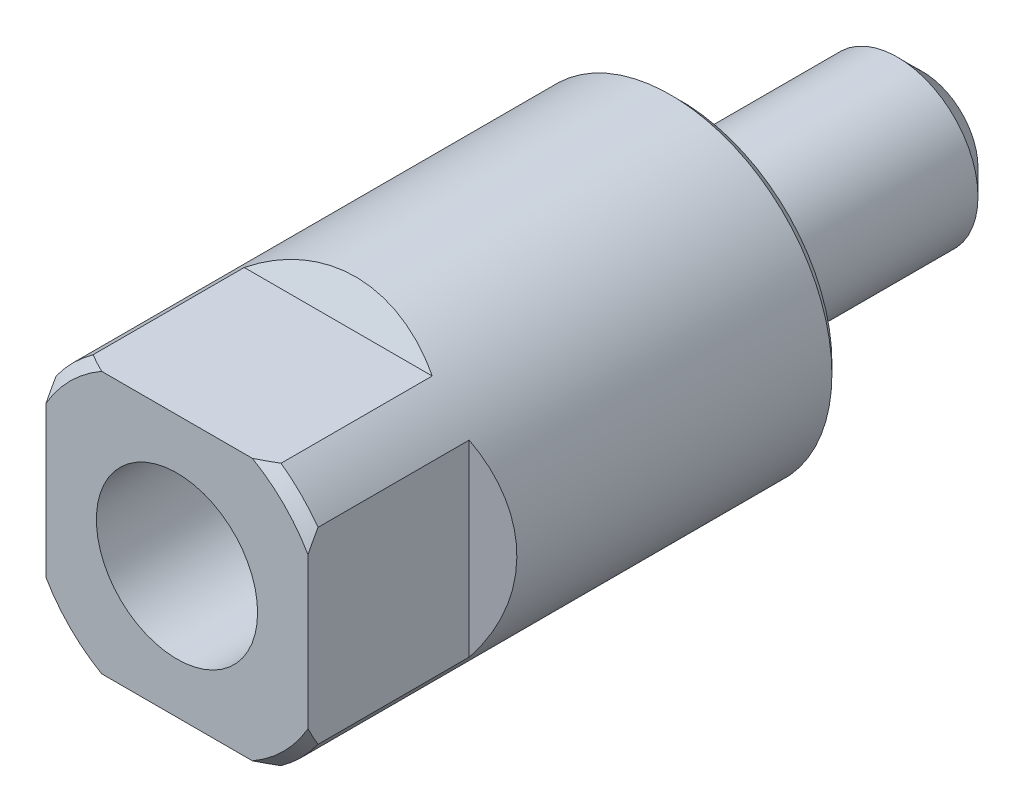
ISO-10303-21;
HEADER;
FILE_DESCRIPTION(('STEP AP214'),'2;1');
FILE_NAME('part.step','',(''),(''),'','','');
FILE_SCHEMA(('AUTOMOTIVE_DESIGN { 1 0 10303 214 1 1 1 1 }'));
ENDSEC;
DATA;
#1=APPLICATION_CONTEXT('core data for automotive mechanical design processes');
#2=APPLICATION_PROTOCOL_DEFINITION('international standard','automotive_design',2000,#1);
#3=PRODUCT_CONTEXT('',#1,'mechanical');
#4=PRODUCT('Part','Part','',(#3));
#5=PRODUCT_RELATED_PRODUCT_CATEGORY('part','',(#4));
#6=PRODUCT_DEFINITION_FORMATION('','',#4);
#7=PRODUCT_DEFINITION_CONTEXT('part definition',#1,'design');
#8=PRODUCT_DEFINITION('design','',#6,#7);
#9=PRODUCT_DEFINITION_SHAPE('','',#8);
#10=(LENGTH_UNIT() NAMED_UNIT(*) SI_UNIT(.MILLI.,.METRE.));
#11=(NAMED_UNIT(*) PLANE_ANGLE_UNIT() SI_UNIT($,.RADIAN.));
#12=(NAMED_UNIT(*) SI_UNIT($,.STERADIAN.) SOLID_ANGLE_UNIT());
#13=UNCERTAINTY_MEASURE_WITH_UNIT(LENGTH_MEASURE(1.E-05),#10,'distance_accuracy_value','');
#14=(GEOMETRIC_REPRESENTATION_CONTEXT(3) GLOBAL_UNCERTAINTY_ASSIGNED_CONTEXT((#13)) GLOBAL_UNIT_ASSIGNED_CONTEXT((#10,
#11,#12)) REPRESENTATION_CONTEXT('',''));
#15=CARTESIAN_POINT('',(0.,0.,0.));
#16=DIRECTION('',(0.,0.,1.));
#17=DIRECTION('',(1.,0.,0.));
#18=AXIS2_PLACEMENT_3D('',#15,#16,#17);
#19=CARTESIAN_POINT('',(0.,0.,-12.));
#20=DIRECTION('',(0.,0.,1.));
#21=DIRECTION('',(1.,0.,0.));
#22=AXIS2_PLACEMENT_3D('',#19,#20,#21);
#23=PLANE('',#22);
#24=CARTESIAN_POINT('',(0.,0.,-12.));
#25=DIRECTION('',(0.,0.,1.));
#26=DIRECTION('',(1.,0.,0.));
#27=AXIS2_PLACEMENT_3D('',#24,#25,#26);
#28=CIRCLE('',#27,2.75);
#29=CARTESIAN_POINT('',(2.75,0.,-12.));
#30=VERTEX_POINT('',#29);
#31=EDGE_CURVE('E142',#30,#30,#28,.F.);
#32=ORIENTED_EDGE('',*,*,#31,.T.);
#33=EDGE_LOOP('',(#32));
#34=FACE_BOUND('',#33,.T.);
#35=ADVANCED_FACE('F14',(#34),#23,.F.);
#36=CARTESIAN_POINT('',(0.,0.,8.));
#37=DIRECTION('',(0.,0.,1.));
#38=DIRECTION('',(1.,0.,0.));
#39=AXIS2_PLACEMENT_3D('',#36,#37,#38);
#40=CYLINDRICAL_SURFACE('',#39,4.);
#41=CARTESIAN_POINT('',(0.,0.,-10.75));
#42=DIRECTION('',(0.,0.,1.));
#43=DIRECTION('',(1.,0.,0.));
#44=AXIS2_PLACEMENT_3D('',#41,#42,#43);
#45=CIRCLE('',#44,4.);
#46=CARTESIAN_POINT('',(4.,0.,-10.75));
#47=VERTEX_POINT('',#46);
#48=EDGE_CURVE('E176',#47,#47,#45,.T.);
#49=ORIENTED_EDGE('',*,*,#48,.T.);
#50=EDGE_LOOP('',(#49));
#51=FACE_BOUND('',#50,.T.);
#52=CARTESIAN_POINT('',(0.,0.,0.));
#53=DIRECTION('',(0.,0.,1.));
#54=DIRECTION('',(1.,0.,0.));
#55=AXIS2_PLACEMENT_3D('',#52,#53,#54);
#56=CIRCLE('',#55,4.);
#57=CARTESIAN_POINT('',(4.,0.,0.));
#58=VERTEX_POINT('',#57);
#59=EDGE_CURVE('E139',#58,#58,#56,.T.);
#60=ORIENTED_EDGE('',*,*,#59,.F.);
#61=EDGE_LOOP('',(#60));
#62=FACE_BOUND('',#61,.T.);
#63=ADVANCED_FACE('F294',(#51,#62),#40,.T.);
#64=CARTESIAN_POINT('',(6.5,-8.,17.));
#65=DIRECTION('',(-0.5,0.,-0.866025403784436));
#66=DIRECTION('',(-0.866025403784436,0.,0.5));
#67=AXIS2_PLACEMENT_3D('',#64,#65,#66);
#68=PLANE('',#67);
#69=CARTESIAN_POINT('',(0.,0.,20.7527767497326));
#70=DIRECTION('',(-0.5,0.,-0.866025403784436));
#71=DIRECTION('',(0.866025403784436,0.,-0.5));
#72=AXIS2_PLACEMENT_3D('',#69,#70,#71);
#73=ELLIPSE('',#72,9.23760430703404,8.);
#74=CARTESIAN_POINT('',(6.5,4.66368952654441,17.));
#75=VERTEX_POINT('',#74);
#76=CARTESIAN_POINT('',(6.5,-4.66368952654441,17.));
#77=VERTEX_POINT('',#76);
#78=EDGE_CURVE('E159',#75,#77,#73,.T.);
#79=ORIENTED_EDGE('',*,*,#78,.F.);
#80=DIRECTION('',(0.,1.,0.));
#81=VECTOR('',#80,1.);
#82=CARTESIAN_POINT('',(6.5,-8.,17.));
#83=LINE('',#82,#81);
#84=EDGE_CURVE('E150',#77,#75,#83,.T.);
#85=ORIENTED_EDGE('',*,*,#84,.F.);
#86=EDGE_LOOP('',(#79,#85));
#87=FACE_BOUND('',#86,.T.);
#88=ADVANCED_FACE('F298',(#87),#68,.F.);
#89=CARTESIAN_POINT('',(6.5,-8.,25.));
#90=DIRECTION('',(-1.,0.,0.));
#91=DIRECTION('',(0.,0.,1.));
#92=AXIS2_PLACEMENT_3D('',#89,#90,#91);
#93=PLANE('',#92);
#94=DIRECTION('',(0.,0.,-1.));
#95=VECTOR('',#94,1.);
#96=CARTESIAN_POINT('',(6.5,4.6636895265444,25.));
#97=LINE('',#96,#95);
#98=CARTESIAN_POINT('',(6.5,4.6636895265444,24.5));
#99=VERTEX_POINT('',#98);
#100=EDGE_CURVE('E155',#99,#75,#97,.T.);
#101=ORIENTED_EDGE('',*,*,#100,.F.);
#102=CARTESIAN_POINT('',(6.5,4.6636895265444,24.5));
#103=CARTESIAN_POINT('',(6.5,4.58815546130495,24.5440319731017));
#104=CARTESIAN_POINT('',(6.5,4.51231410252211,24.5875397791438));
#105=CARTESIAN_POINT('',(6.5,4.36000596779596,24.6733985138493));
#106=CARTESIAN_POINT('',(6.5,4.2835393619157,24.7157497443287));
#107=CARTESIAN_POINT('',(6.5,4.12992806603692,24.7992112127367));
#108=CARTESIAN_POINT('',(6.5,4.05278335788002,24.8403214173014));
#109=CARTESIAN_POINT('',(6.5,3.89776768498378,24.9211989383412));
#110=CARTESIAN_POINT('',(6.5,3.81989653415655,24.9609658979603));
#111=CARTESIAN_POINT('',(6.5,3.74165738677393,25.));
#112=B_SPLINE_CURVE_WITH_KNOTS('',3,(#102,#103,#104,#105,#106,#107,#108,#109,#110,#111),
.UNSPECIFIED.,.F.,.F.,(4,2,2,2,4),(0.,0.262293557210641,0.524518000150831,0.786749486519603,
1.04905009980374),.UNSPECIFIED.);
#113=CARTESIAN_POINT('',(6.5,3.74165738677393,25.));
#114=VERTEX_POINT('',#113);
#115=EDGE_CURVE('E277',#99,#114,#112,.T.);
#116=ORIENTED_EDGE('',*,*,#115,.T.);
#117=DIRECTION('',(0.,-1.,0.));
#118=VECTOR('',#117,1.);
#119=CARTESIAN_POINT('',(6.5,0.,25.));
#120=LINE('',#119,#118);
#121=CARTESIAN_POINT('',(6.5,-3.74165738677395,25.));
#122=VERTEX_POINT('',#121);
#123=EDGE_CURVE('E157',#114,#122,#120,.T.);
#124=ORIENTED_EDGE('',*,*,#123,.T.);
#125=CARTESIAN_POINT('',(6.5,-3.74165738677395,25.));
#126=CARTESIAN_POINT('',(6.5,-3.81989653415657,24.9609658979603));
#127=CARTESIAN_POINT('',(6.5,-3.89776768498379,24.9211989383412));
#128=CARTESIAN_POINT('',(6.5,-4.05278335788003,24.8403214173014));
#129=CARTESIAN_POINT('',(6.5,-4.12992806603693,24.7992112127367));
#130=CARTESIAN_POINT('',(6.5,-4.28353936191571,24.7157497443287));
#131=CARTESIAN_POINT('',(6.5,-4.36000596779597,24.6733985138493));
#132=CARTESIAN_POINT('',(6.5,-4.51231410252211,24.5875397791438));
#133=CARTESIAN_POINT('',(6.5,-4.58815546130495,24.5440319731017));
#134=CARTESIAN_POINT('',(6.5,-4.6636895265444,24.5));
#135=B_SPLINE_CURVE_WITH_KNOTS('',3,(#125,#126,#127,#128,#129,#130,#131,#132,#133,#134),
.UNSPECIFIED.,.F.,.F.,(4,2,2,2,4),(0.,0.262300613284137,0.524532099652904,0.786756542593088,
1.04905009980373),.UNSPECIFIED.);
#136=CARTESIAN_POINT('',(6.5,-4.6636895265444,24.5));
#137=VERTEX_POINT('',#136);
#138=EDGE_CURVE('E29',#122,#137,#135,.T.);
#139=ORIENTED_EDGE('',*,*,#138,.T.);
#140=DIRECTION('',(0.,0.,-1.));
#141=VECTOR('',#140,1.);
#142=CARTESIAN_POINT('',(6.5,-4.6636895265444,25.));
#143=LINE('',#142,#141);
#144=EDGE_CURVE('E153',#77,#137,#143,.F.);
#145=ORIENTED_EDGE('',*,*,#144,.F.);
#146=ORIENTED_EDGE('',*,*,#84,.T.);
#147=EDGE_LOOP('',(#101,#116,#124,#139,#145,#146));
#148=FACE_BOUND('',#147,.T.);
#149=ADVANCED_FACE('F222',(#148),#93,.F.);
#150=CARTESIAN_POINT('',(8.,6.5,17.));
#151=DIRECTION('',(0.,-0.5,-0.866025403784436));
#152=DIRECTION('',(0.,0.866025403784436,-0.5));
#153=AXIS2_PLACEMENT_3D('',#150,#151,#152);
#154=PLANE('',#153);
#155=CARTESIAN_POINT('',(0.,0.,20.7527767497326));
#156=DIRECTION('',(0.,-0.5,-0.866025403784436));
#157=DIRECTION('',(0.,0.866025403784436,-0.5));
#158=AXIS2_PLACEMENT_3D('',#155,#156,#157);
#159=ELLIPSE('',#158,9.23760430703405,8.);
#160=CARTESIAN_POINT('',(-4.66368952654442,6.5,17.));
#161=VERTEX_POINT('',#160);
#162=CARTESIAN_POINT('',(4.66368952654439,6.5,17.));
#163=VERTEX_POINT('',#162);
#164=EDGE_CURVE('E169',#161,#163,#159,.T.);
#165=ORIENTED_EDGE('',*,*,#164,.F.);
#166=DIRECTION('',(-1.,0.,0.));
#167=VECTOR('',#166,1.);
#168=CARTESIAN_POINT('',(8.,6.5,17.));
#169=LINE('',#168,#167);
#170=EDGE_CURVE('E114',#163,#161,#169,.T.);
#171=ORIENTED_EDGE('',*,*,#170,.F.);
#172=EDGE_LOOP('',(#165,#171));
#173=FACE_BOUND('',#172,.T.);
#174=ADVANCED_FACE('F215',(#173),#154,.F.);
#175=CARTESIAN_POINT('',(8.,6.5,25.));
#176=DIRECTION('',(0.,-1.,0.));
#177=DIRECTION('',(1.,0.,0.));
#178=AXIS2_PLACEMENT_3D('',#175,#176,#177);
#179=PLANE('',#178);
#180=DIRECTION('',(1.,0.,0.));
#181=VECTOR('',#180,1.);
#182=CARTESIAN_POINT('',(0.,6.5,25.));
#183=LINE('',#182,#181);
#184=CARTESIAN_POINT('',(-3.74165738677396,6.5,25.));
#185=VERTEX_POINT('',#184);
#186=CARTESIAN_POINT('',(3.7416573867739,6.5,25.));
#187=VERTEX_POINT('',#186);
#188=EDGE_CURVE('E166',#185,#187,#183,.T.);
#189=ORIENTED_EDGE('',*,*,#188,.T.);
#190=CARTESIAN_POINT('',(3.7416573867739,6.5,25.));
#191=CARTESIAN_POINT('',(3.81989653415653,6.49999999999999,24.9609658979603));
#192=CARTESIAN_POINT('',(3.89776768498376,6.49999999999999,24.9211989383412));
#193=CARTESIAN_POINT('',(4.05278335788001,6.49999999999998,24.8403214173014));
#194=CARTESIAN_POINT('',(4.12992806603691,6.49999999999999,24.7992112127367));
#195=CARTESIAN_POINT('',(4.2835393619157,6.49999999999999,24.7157497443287));
#196=CARTESIAN_POINT('',(4.36000596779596,6.49999999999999,24.6733985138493));
#197=CARTESIAN_POINT('',(4.51231410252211,6.49999999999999,24.5875397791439));
#198=CARTESIAN_POINT('',(4.58815546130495,6.49999999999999,24.5440319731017));
#199=CARTESIAN_POINT('',(4.6636895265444,6.5,24.5));
#200=B_SPLINE_CURVE_WITH_KNOTS('',3,(#190,#191,#192,#193,#194,#195,#196,#197,#198,#199),
.UNSPECIFIED.,.F.,.F.,(4,2,2,2,4),(0.,0.262300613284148,0.524532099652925,0.786756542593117,
1.04905009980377),.UNSPECIFIED.);
#201=CARTESIAN_POINT('',(4.66368952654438,6.5,24.5));
#202=VERTEX_POINT('',#201);
#203=EDGE_CURVE('E199',#187,#202,#200,.T.);
#204=ORIENTED_EDGE('',*,*,#203,.T.);
#205=DIRECTION('',(0.,0.,-1.));
#206=VECTOR('',#205,1.);
#207=CARTESIAN_POINT('',(4.66368952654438,6.5,25.));
#208=LINE('',#207,#206);
#209=EDGE_CURVE('E134',#163,#202,#208,.F.);
#210=ORIENTED_EDGE('',*,*,#209,.F.);
#211=ORIENTED_EDGE('',*,*,#170,.T.);
#212=DIRECTION('',(0.,0.,-1.));
#213=VECTOR('',#212,1.);
#214=CARTESIAN_POINT('',(-4.66368952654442,6.5,25.));
#215=LINE('',#214,#213);
#216=CARTESIAN_POINT('',(-4.66368952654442,6.5,24.5));
#217=VERTEX_POINT('',#216);
#218=EDGE_CURVE('E136',#217,#161,#215,.T.);
#219=ORIENTED_EDGE('',*,*,#218,.F.);
#220=CARTESIAN_POINT('',(-4.66368952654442,6.5,24.5));
#221=CARTESIAN_POINT('',(-4.58815546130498,6.49999999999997,24.5440319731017));
#222=CARTESIAN_POINT('',(-4.51231410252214,6.49999999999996,24.5875397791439));
#223=CARTESIAN_POINT('',(-4.360005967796,6.49999999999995,24.6733985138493));
#224=CARTESIAN_POINT('',(-4.28353936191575,6.49999999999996,24.7157497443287));
#225=CARTESIAN_POINT('',(-4.12992806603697,6.49999999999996,24.7992112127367));
#226=CARTESIAN_POINT('',(-4.05278335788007,6.49999999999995,24.8403214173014));
#227=CARTESIAN_POINT('',(-3.89776768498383,6.49999999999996,24.9211989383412));
#228=CARTESIAN_POINT('',(-3.8198965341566,6.49999999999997,24.9609658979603));
#229=CARTESIAN_POINT('',(-3.74165738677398,6.5,25.));
#230=B_SPLINE_CURVE_WITH_KNOTS('',3,(#220,#221,#222,#223,#224,#225,#226,#227,#228,#229),
.UNSPECIFIED.,.F.,.F.,(4,2,2,2,4),(0.,0.262293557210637,0.524518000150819,0.786749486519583,
1.04905009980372),.UNSPECIFIED.);
#231=EDGE_CURVE('E191',#217,#185,#230,.T.);
#232=ORIENTED_EDGE('',*,*,#231,.T.);
#233=EDGE_LOOP('',(#189,#204,#210,#211,#219,#232));
#234=FACE_BOUND('',#233,.T.);
#235=ADVANCED_FACE('F209',(#234),#179,.F.);
#236=CARTESIAN_POINT('',(-6.5,-8.,17.));
#237=DIRECTION('',(0.5,0.,-0.866025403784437));
#238=DIRECTION('',(-0.866025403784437,0.,-0.5));
#239=AXIS2_PLACEMENT_3D('',#236,#237,#238);
#240=PLANE('',#239);
#241=CARTESIAN_POINT('',(0.,0.,20.7527767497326));
#242=DIRECTION('',(0.5,0.,-0.866025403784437));
#243=DIRECTION('',(-0.866025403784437,0.,-0.5));
#244=AXIS2_PLACEMENT_3D('',#241,#242,#243);
#245=ELLIPSE('',#244,9.23760430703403,8.);
#246=CARTESIAN_POINT('',(-6.5,-4.66368952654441,17.));
#247=VERTEX_POINT('',#246);
#248=CARTESIAN_POINT('',(-6.5,4.66368952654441,17.));
#249=VERTEX_POINT('',#248);
#250=EDGE_CURVE('E164',#247,#249,#245,.T.);
#251=ORIENTED_EDGE('',*,*,#250,.F.);
#252=DIRECTION('',(0.,1.,0.));
#253=VECTOR('',#252,1.);
#254=CARTESIAN_POINT('',(-6.5,-8.,17.));
#255=LINE('',#254,#253);
#256=EDGE_CURVE('E138',#247,#249,#255,.T.);
#257=ORIENTED_EDGE('',*,*,#256,.T.);
#258=EDGE_LOOP('',(#251,#257));
#259=FACE_BOUND('',#258,.T.);
#260=ADVANCED_FACE('F214',(#259),#240,.F.);
#261=CARTESIAN_POINT('',(-6.5,-8.,25.));
#262=DIRECTION('',(1.,0.,0.));
#263=DIRECTION('',(0.,0.,-1.));
#264=AXIS2_PLACEMENT_3D('',#261,#262,#263);
#265=PLANE('',#264);
#266=DIRECTION('',(0.,1.,0.));
#267=VECTOR('',#266,1.);
#268=CARTESIAN_POINT('',(-6.5,0.,25.));
#269=LINE('',#268,#267);
#270=CARTESIAN_POINT('',(-6.5,-3.74165738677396,25.));
#271=VERTEX_POINT('',#270);
#272=CARTESIAN_POINT('',(-6.5,3.74165738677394,25.));
#273=VERTEX_POINT('',#272);
#274=EDGE_CURVE('E161',#271,#273,#269,.T.);
#275=ORIENTED_EDGE('',*,*,#274,.T.);
#276=CARTESIAN_POINT('',(-6.5,3.74165738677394,25.));
#277=CARTESIAN_POINT('',(-6.5,3.81989653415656,24.9609658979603));
#278=CARTESIAN_POINT('',(-6.5,3.89776768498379,24.9211989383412));
#279=CARTESIAN_POINT('',(-6.5,4.05278335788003,24.8403214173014));
#280=CARTESIAN_POINT('',(-6.5,4.12992806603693,24.7992112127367));
#281=CARTESIAN_POINT('',(-6.5,4.28353936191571,24.7157497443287));
#282=CARTESIAN_POINT('',(-6.5,4.36000596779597,24.6733985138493));
#283=CARTESIAN_POINT('',(-6.5,4.51231410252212,24.5875397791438));
#284=CARTESIAN_POINT('',(-6.5,4.58815546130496,24.5440319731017));
#285=CARTESIAN_POINT('',(-6.5,4.66368952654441,24.5));
#286=B_SPLINE_CURVE_WITH_KNOTS('',3,(#276,#277,#278,#279,#280,#281,#282,#283,#284,#285),
.UNSPECIFIED.,.F.,.F.,(4,2,2,2,4),(0.,0.26230061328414,0.524532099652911,0.786756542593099,
1.04905009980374),.UNSPECIFIED.);
#287=CARTESIAN_POINT('',(-6.5,4.66368952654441,24.5));
#288=VERTEX_POINT('',#287);
#289=EDGE_CURVE('E249',#273,#288,#286,.T.);
#290=ORIENTED_EDGE('',*,*,#289,.T.);
#291=DIRECTION('',(0.,0.,-1.));
#292=VECTOR('',#291,1.);
#293=CARTESIAN_POINT('',(-6.5,4.66368952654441,25.));
#294=LINE('',#293,#292);
#295=EDGE_CURVE('E145',#249,#288,#294,.F.);
#296=ORIENTED_EDGE('',*,*,#295,.F.);
#297=ORIENTED_EDGE('',*,*,#256,.F.);
#298=DIRECTION('',(0.,0.,-1.));
#299=VECTOR('',#298,1.);
#300=CARTESIAN_POINT('',(-6.5,-4.66368952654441,25.));
#301=LINE('',#300,#299);
#302=CARTESIAN_POINT('',(-6.5,-4.66368952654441,24.5));
#303=VERTEX_POINT('',#302);
#304=EDGE_CURVE('E148',#303,#247,#301,.T.);
#305=ORIENTED_EDGE('',*,*,#304,.F.);
#306=CARTESIAN_POINT('',(-6.5,-4.66368952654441,24.5));
#307=CARTESIAN_POINT('',(-6.5,-4.58815546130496,24.5440319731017));
#308=CARTESIAN_POINT('',(-6.5,-4.51231410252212,24.5875397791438));
#309=CARTESIAN_POINT('',(-6.5,-4.36000596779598,24.6733985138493));
#310=CARTESIAN_POINT('',(-6.5,-4.28353936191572,24.7157497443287));
#311=CARTESIAN_POINT('',(-6.5,-4.12992806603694,24.7992112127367));
#312=CARTESIAN_POINT('',(-6.5,-4.05278335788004,24.8403214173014));
#313=CARTESIAN_POINT('',(-6.5,-3.89776768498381,24.9211989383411));
#314=CARTESIAN_POINT('',(-6.5,-3.81989653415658,24.9609658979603));
#315=CARTESIAN_POINT('',(-6.5,-3.74165738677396,25.));
#316=B_SPLINE_CURVE_WITH_KNOTS('',3,(#306,#307,#308,#309,#310,#311,#312,#313,#314,#315),
.UNSPECIFIED.,.F.,.F.,(4,2,2,2,4),(0.,0.262293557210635,0.524518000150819,0.786749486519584,
1.04905009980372),.UNSPECIFIED.);
#317=EDGE_CURVE('E242',#303,#271,#316,.T.);
#318=ORIENTED_EDGE('',*,*,#317,.T.);
#319=EDGE_LOOP('',(#275,#290,#296,#297,#305,#318));
#320=FACE_BOUND('',#319,.T.);
#321=ADVANCED_FACE('F224',(#320),#265,.F.);
#322=CARTESIAN_POINT('',(8.,-6.5,17.));
#323=DIRECTION('',(0.,0.5,-0.866025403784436));
#324=DIRECTION('',(0.,0.866025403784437,0.5));
#325=AXIS2_PLACEMENT_3D('',#322,#323,#324);
#326=PLANE('',#325);
#327=CARTESIAN_POINT('',(0.,0.,20.7527767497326));
#328=DIRECTION('',(0.,0.5,-0.866025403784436));
#329=DIRECTION('',(0.,-0.866025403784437,-0.5));
#330=AXIS2_PLACEMENT_3D('',#327,#328,#329);
#331=ELLIPSE('',#330,9.23760430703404,8.);
#332=CARTESIAN_POINT('',(4.66368952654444,-6.5,17.));
#333=VERTEX_POINT('',#332);
#334=CARTESIAN_POINT('',(-4.66368952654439,-6.5,17.));
#335=VERTEX_POINT('',#334);
#336=EDGE_CURVE('E107',#333,#335,#331,.T.);
#337=ORIENTED_EDGE('',*,*,#336,.F.);
#338=DIRECTION('',(-1.,0.,0.));
#339=VECTOR('',#338,1.);
#340=CARTESIAN_POINT('',(8.,-6.5,17.));
#341=LINE('',#340,#339);
#342=EDGE_CURVE('E120',#333,#335,#341,.T.);
#343=ORIENTED_EDGE('',*,*,#342,.T.);
#344=EDGE_LOOP('',(#337,#343));
#345=FACE_BOUND('',#344,.T.);
#346=ADVANCED_FACE('F119',(#345),#326,.F.);
#347=CARTESIAN_POINT('',(8.,-6.5,25.));
#348=DIRECTION('',(0.,1.,0.));
#349=DIRECTION('',(-1.,0.,0.));
#350=AXIS2_PLACEMENT_3D('',#347,#348,#349);
#351=PLANE('',#350);
#352=DIRECTION('',(-1.,0.,0.));
#353=VECTOR('',#352,1.);
#354=CARTESIAN_POINT('',(0.,-6.5,25.));
#355=LINE('',#354,#353);
#356=CARTESIAN_POINT('',(3.74165738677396,-6.5,25.));
#357=VERTEX_POINT('',#356);
#358=CARTESIAN_POINT('',(-3.74165738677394,-6.5,25.));
#359=VERTEX_POINT('',#358);
#360=EDGE_CURVE('E122',#357,#359,#355,.T.);
#361=ORIENTED_EDGE('',*,*,#360,.T.);
#362=CARTESIAN_POINT('',(-3.74165738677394,-6.5,25.));
#363=CARTESIAN_POINT('',(-3.81989653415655,-6.50000000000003,24.9609658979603));
#364=CARTESIAN_POINT('',(-3.89776768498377,-6.50000000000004,24.9211989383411));
#365=CARTESIAN_POINT('',(-4.05278335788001,-6.50000000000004,24.8403214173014));
#366=CARTESIAN_POINT('',(-4.12992806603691,-6.50000000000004,24.7992112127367));
#367=CARTESIAN_POINT('',(-4.28353936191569,-6.50000000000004,24.7157497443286));
#368=CARTESIAN_POINT('',(-4.36000596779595,-6.50000000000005,24.6733985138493));
#369=CARTESIAN_POINT('',(-4.51231410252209,-6.50000000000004,24.5875397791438));
#370=CARTESIAN_POINT('',(-4.58815546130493,-6.50000000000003,24.5440319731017));
#371=CARTESIAN_POINT('',(-4.66368952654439,-6.5,24.5));
#372=B_SPLINE_CURVE_WITH_KNOTS('',3,(#362,#363,#364,#365,#366,#367,#368,#369,#370,#371),
.UNSPECIFIED.,.F.,.F.,(4,2,2,2,4),(0.,0.262300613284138,0.524532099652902,0.786756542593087,
1.04905009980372),.UNSPECIFIED.);
#373=CARTESIAN_POINT('',(-4.66368952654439,-6.5,24.5));
#374=VERTEX_POINT('',#373);
#375=EDGE_CURVE('E22',#359,#374,#372,.T.);
#376=ORIENTED_EDGE('',*,*,#375,.T.);
#377=DIRECTION('',(0.,0.,-1.));
#378=VECTOR('',#377,1.);
#379=CARTESIAN_POINT('',(-4.66368952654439,-6.5,25.));
#380=LINE('',#379,#378);
#381=EDGE_CURVE('E115',#335,#374,#380,.F.);
#382=ORIENTED_EDGE('',*,*,#381,.F.);
#383=ORIENTED_EDGE('',*,*,#342,.F.);
#384=DIRECTION('',(0.,0.,-1.));
#385=VECTOR('',#384,1.);
#386=CARTESIAN_POINT('',(4.66368952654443,-6.5,25.));
#387=LINE('',#386,#385);
#388=CARTESIAN_POINT('',(4.66368952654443,-6.5,24.5));
#389=VERTEX_POINT('',#388);
#390=EDGE_CURVE('E103',#389,#333,#387,.T.);
#391=ORIENTED_EDGE('',*,*,#390,.F.);
#392=CARTESIAN_POINT('',(4.66368952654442,-6.5,24.5));
#393=CARTESIAN_POINT('',(4.58815546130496,-6.50000000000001,24.5440319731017));
#394=CARTESIAN_POINT('',(4.51231410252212,-6.50000000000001,24.5875397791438));
#395=CARTESIAN_POINT('',(4.36000596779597,-6.50000000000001,24.6733985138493));
#396=CARTESIAN_POINT('',(4.28353936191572,-6.50000000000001,24.7157497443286));
#397=CARTESIAN_POINT('',(4.12992806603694,-6.50000000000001,24.7992112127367));
#398=CARTESIAN_POINT('',(4.05278335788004,-6.50000000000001,24.8403214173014));
#399=CARTESIAN_POINT('',(3.8977676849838,-6.50000000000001,24.9211989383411));
#400=CARTESIAN_POINT('',(3.81989653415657,-6.50000000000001,24.9609658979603));
#401=CARTESIAN_POINT('',(3.74165738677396,-6.5,25.));
#402=B_SPLINE_CURVE_WITH_KNOTS('',3,(#392,#393,#394,#395,#396,#397,#398,#399,#400,#401),
.UNSPECIFIED.,.F.,.F.,(4,2,2,2,4),(0.,0.262293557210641,0.524518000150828,0.786749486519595,
1.04905009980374),.UNSPECIFIED.);
#403=EDGE_CURVE('E255',#389,#357,#402,.T.);
#404=ORIENTED_EDGE('',*,*,#403,.T.);
#405=EDGE_LOOP('',(#361,#376,#382,#383,#391,#404));
#406=FACE_BOUND('',#405,.T.);
#407=ADVANCED_FACE('F125',(#406),#351,.F.);
#408=CARTESIAN_POINT('',(0.,0.,25.));
#409=DIRECTION('',(0.,0.,1.));
#410=DIRECTION('',(1.,0.,0.));
#411=AXIS2_PLACEMENT_3D('',#408,#409,#410);
#412=PLANE('',#411);
#413=ORIENTED_EDGE('',*,*,#123,.F.);
#414=CARTESIAN_POINT('',(0.,0.,25.));
#415=DIRECTION('',(0.,0.,1.));
#416=DIRECTION('',(1.,0.,0.));
#417=AXIS2_PLACEMENT_3D('',#414,#415,#416);
#418=CIRCLE('',#417,7.5);
#419=EDGE_CURVE('E188',#114,#187,#418,.T.);
#420=ORIENTED_EDGE('',*,*,#419,.T.);
#421=ORIENTED_EDGE('',*,*,#188,.F.);
#422=CARTESIAN_POINT('',(0.,0.,25.));
#423=DIRECTION('',(0.,0.,1.));
#424=DIRECTION('',(1.,0.,0.));
#425=AXIS2_PLACEMENT_3D('',#422,#423,#424);
#426=CIRCLE('',#425,7.5);
#427=EDGE_CURVE('E185',#185,#273,#426,.T.);
#428=ORIENTED_EDGE('',*,*,#427,.T.);
#429=ORIENTED_EDGE('',*,*,#274,.F.);
#430=CARTESIAN_POINT('',(0.,0.,25.));
#431=DIRECTION('',(0.,0.,1.));
#432=DIRECTION('',(1.,0.,0.));
#433=AXIS2_PLACEMENT_3D('',#430,#431,#432);
#434=CIRCLE('',#433,7.5);
#435=EDGE_CURVE('E182',#271,#359,#434,.T.);
#436=ORIENTED_EDGE('',*,*,#435,.T.);
#437=ORIENTED_EDGE('',*,*,#360,.F.);
#438=CARTESIAN_POINT('',(0.,0.,25.));
#439=DIRECTION('',(0.,0.,1.));
#440=DIRECTION('',(1.,0.,0.));
#441=AXIS2_PLACEMENT_3D('',#438,#439,#440);
#442=CIRCLE('',#441,7.5);
#443=EDGE_CURVE('E179',#357,#122,#442,.T.);
#444=ORIENTED_EDGE('',*,*,#443,.T.);
#445=EDGE_LOOP('',(#413,#420,#421,#428,#429,#436,#437,#444));
#446=FACE_BOUND('',#445,.T.);
#447=CARTESIAN_POINT('',(0.,0.,25.));
#448=DIRECTION('',(0.,0.,1.));
#449=DIRECTION('',(1.,0.,0.));
#450=AXIS2_PLACEMENT_3D('',#447,#448,#449);
#451=CIRCLE('',#450,4.);
#452=CARTESIAN_POINT('',(4.,0.,25.));
#453=VERTEX_POINT('',#452);
#454=EDGE_CURVE('E126',#453,#453,#451,.T.);
#455=ORIENTED_EDGE('',*,*,#454,.F.);
#456=EDGE_LOOP('',(#455));
#457=FACE_BOUND('',#456,.T.);
#458=ADVANCED_FACE('F306',(#446,#457),#412,.T.);
#459=CARTESIAN_POINT('',(0.,0.,25.));
#460=DIRECTION('',(0.,0.,-1.));
#461=DIRECTION('',(-1.,0.,0.));
#462=AXIS2_PLACEMENT_3D('',#459,#460,#461);
#463=CYLINDRICAL_SURFACE('',#462,8.);
#464=CARTESIAN_POINT('',(0.,0.,0.499999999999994));
#465=DIRECTION('',(0.,0.,1.));
#466=DIRECTION('',(1.,0.,0.));
#467=AXIS2_PLACEMENT_3D('',#464,#465,#466);
#468=CIRCLE('',#467,8.);
#469=CARTESIAN_POINT('',(8.,0.,0.499999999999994));
#470=VERTEX_POINT('',#469);
#471=EDGE_CURVE('E325',#470,#470,#468,.T.);
#472=ORIENTED_EDGE('',*,*,#471,.T.);
#473=EDGE_LOOP('',(#472));
#474=FACE_BOUND('',#473,.T.);
#475=ORIENTED_EDGE('',*,*,#209,.T.);
#476=CARTESIAN_POINT('',(0.,0.,24.5));
#477=DIRECTION('',(0.,0.,1.));
#478=DIRECTION('',(1.,0.,0.));
#479=AXIS2_PLACEMENT_3D('',#476,#477,#478);
#480=CIRCLE('',#479,8.);
#481=EDGE_CURVE('E37',#202,#99,#480,.F.);
#482=ORIENTED_EDGE('',*,*,#481,.T.);
#483=ORIENTED_EDGE('',*,*,#100,.T.);
#484=ORIENTED_EDGE('',*,*,#78,.T.);
#485=ORIENTED_EDGE('',*,*,#144,.T.);
#486=CARTESIAN_POINT('',(0.,0.,24.5));
#487=DIRECTION('',(0.,0.,1.));
#488=DIRECTION('',(1.,0.,0.));
#489=AXIS2_PLACEMENT_3D('',#486,#487,#488);
#490=CIRCLE('',#489,8.);
#491=EDGE_CURVE('E110',#137,#389,#490,.F.);
#492=ORIENTED_EDGE('',*,*,#491,.T.);
#493=ORIENTED_EDGE('',*,*,#390,.T.);
#494=ORIENTED_EDGE('',*,*,#336,.T.);
#495=ORIENTED_EDGE('',*,*,#381,.T.);
#496=CARTESIAN_POINT('',(0.,0.,24.5));
#497=DIRECTION('',(0.,0.,1.));
#498=DIRECTION('',(1.,0.,0.));
#499=AXIS2_PLACEMENT_3D('',#496,#497,#498);
#500=CIRCLE('',#499,8.);
#501=EDGE_CURVE('E324',#374,#303,#500,.F.);
#502=ORIENTED_EDGE('',*,*,#501,.T.);
#503=ORIENTED_EDGE('',*,*,#304,.T.);
#504=ORIENTED_EDGE('',*,*,#250,.T.);
#505=ORIENTED_EDGE('',*,*,#295,.T.);
#506=CARTESIAN_POINT('',(0.,0.,24.5));
#507=DIRECTION('',(0.,0.,1.));
#508=DIRECTION('',(1.,0.,0.));
#509=AXIS2_PLACEMENT_3D('',#506,#507,#508);
#510=CIRCLE('',#509,8.);
#511=EDGE_CURVE('E327',#288,#217,#510,.F.);
#512=ORIENTED_EDGE('',*,*,#511,.T.);
#513=ORIENTED_EDGE('',*,*,#218,.T.);
#514=ORIENTED_EDGE('',*,*,#164,.T.);
#515=EDGE_LOOP('',(#475,#482,#483,#484,#485,#492,#493,#494,#495,#502,#503,#504,#505,#512,#513,#514));
#516=FACE_BOUND('',#515,.T.);
#517=ADVANCED_FACE('F105',(#474,#516),#463,.T.);
#518=CARTESIAN_POINT('',(0.,0.,0.));
#519=DIRECTION('',(0.,0.,1.));
#520=DIRECTION('',(1.,0.,0.));
#521=AXIS2_PLACEMENT_3D('',#518,#519,#520);
#522=PLANE('',#521);
#523=CARTESIAN_POINT('',(0.,0.,0.));
#524=DIRECTION('',(0.,0.,1.));
#525=DIRECTION('',(1.,0.,0.));
#526=AXIS2_PLACEMENT_3D('',#523,#524,#525);
#527=CIRCLE('',#526,7.5);
#528=CARTESIAN_POINT('',(7.5,0.,0.));
#529=VERTEX_POINT('',#528);
#530=EDGE_CURVE('E9',#529,#529,#527,.F.);
#531=ORIENTED_EDGE('',*,*,#530,.T.);
#532=EDGE_LOOP('',(#531));
#533=FACE_BOUND('',#532,.T.);
#534=ORIENTED_EDGE('',*,*,#59,.T.);
#535=EDGE_LOOP('',(#534));
#536=FACE_BOUND('',#535,.T.);
#537=ADVANCED_FACE('F302',(#533,#536),#522,.F.);
#538=CARTESIAN_POINT('',(4.,0.,8.));
#539=DIRECTION('',(0.,0.,-1.));
#540=DIRECTION('',(-1.,0.,0.));
#541=AXIS2_PLACEMENT_3D('',#538,#539,#540);
#542=PLANE('',#541);
#543=CARTESIAN_POINT('',(0.,0.,8.));
#544=DIRECTION('',(0.,0.,1.));
#545=DIRECTION('',(1.,0.,0.));
#546=AXIS2_PLACEMENT_3D('',#543,#544,#545);
#547=CIRCLE('',#546,4.);
#548=CARTESIAN_POINT('',(4.,0.,8.));
#549=VERTEX_POINT('',#548);
#550=EDGE_CURVE('E121',#549,#549,#547,.T.);
#551=ORIENTED_EDGE('',*,*,#550,.T.);
#552=EDGE_LOOP('',(#551));
#553=FACE_BOUND('',#552,.T.);
#554=ADVANCED_FACE('F229',(#553),#542,.F.);
#555=CARTESIAN_POINT('',(0.,0.,25.));
#556=DIRECTION('',(0.,0.,1.));
#557=DIRECTION('',(1.,0.,0.));
#558=AXIS2_PLACEMENT_3D('',#555,#556,#557);
#559=CYLINDRICAL_SURFACE('',#558,4.);
#560=ORIENTED_EDGE('',*,*,#550,.F.);
#561=EDGE_LOOP('',(#560));
#562=FACE_BOUND('',#561,.T.);
#563=ORIENTED_EDGE('',*,*,#454,.T.);
#564=EDGE_LOOP('',(#563));
#565=FACE_BOUND('',#564,.T.);
#566=ADVANCED_FACE('F225',(#562,#565),#559,.F.);
#567=CARTESIAN_POINT('',(0.,0.,-12.));
#568=DIRECTION('',(0.,0.,1.));
#569=DIRECTION('',(1.,0.,0.));
#570=AXIS2_PLACEMENT_3D('',#567,#568,#569);
#571=CONICAL_SURFACE('',#570,2.75,0.785398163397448);
#572=ORIENTED_EDGE('',*,*,#48,.F.);
#573=EDGE_LOOP('',(#572));
#574=FACE_BOUND('',#573,.T.);
#575=ORIENTED_EDGE('',*,*,#31,.F.);
#576=EDGE_LOOP('',(#575));
#577=FACE_BOUND('',#576,.T.);
#578=ADVANCED_FACE('F228',(#574,#577),#571,.T.);
#579=CARTESIAN_POINT('',(0.,0.,25.));
#580=DIRECTION('',(0.,0.,-1.));
#581=DIRECTION('',(-1.,0.,0.));
#582=AXIS2_PLACEMENT_3D('',#579,#580,#581);
#583=CONICAL_SURFACE('',#582,7.5,0.78539816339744);
#584=ORIENTED_EDGE('',*,*,#115,.F.);
#585=ORIENTED_EDGE('',*,*,#481,.F.);
#586=ORIENTED_EDGE('',*,*,#203,.F.);
#587=ORIENTED_EDGE('',*,*,#419,.F.);
#588=EDGE_LOOP('',(#584,#585,#586,#587));
#589=FACE_BOUND('',#588,.T.);
#590=ADVANCED_FACE('F283',(#589),#583,.T.);
#591=CARTESIAN_POINT('',(0.,0.,25.));
#592=DIRECTION('',(0.,0.,-1.));
#593=DIRECTION('',(-1.,0.,0.));
#594=AXIS2_PLACEMENT_3D('',#591,#592,#593);
#595=CONICAL_SURFACE('',#594,7.5,0.785398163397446);
#596=ORIENTED_EDGE('',*,*,#231,.F.);
#597=ORIENTED_EDGE('',*,*,#511,.F.);
#598=ORIENTED_EDGE('',*,*,#289,.F.);
#599=ORIENTED_EDGE('',*,*,#427,.F.);
#600=EDGE_LOOP('',(#596,#597,#598,#599));
#601=FACE_BOUND('',#600,.T.);
#602=ADVANCED_FACE('F206',(#601),#595,.T.);
#603=CARTESIAN_POINT('',(0.,0.,25.));
#604=DIRECTION('',(0.,0.,-1.));
#605=DIRECTION('',(-1.,0.,0.));
#606=AXIS2_PLACEMENT_3D('',#603,#604,#605);
#607=CONICAL_SURFACE('',#606,7.5,0.78539816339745);
#608=ORIENTED_EDGE('',*,*,#317,.F.);
#609=ORIENTED_EDGE('',*,*,#501,.F.);
#610=ORIENTED_EDGE('',*,*,#375,.F.);
#611=ORIENTED_EDGE('',*,*,#435,.F.);
#612=EDGE_LOOP('',(#608,#609,#610,#611));
#613=FACE_BOUND('',#612,.T.);
#614=ADVANCED_FACE('F267',(#613),#607,.T.);
#615=CARTESIAN_POINT('',(0.,0.,25.));
#616=DIRECTION('',(0.,0.,-1.));
#617=DIRECTION('',(-1.,0.,0.));
#618=AXIS2_PLACEMENT_3D('',#615,#616,#617);
#619=CONICAL_SURFACE('',#618,7.5,0.785398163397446);
#620=ORIENTED_EDGE('',*,*,#403,.F.);
#621=ORIENTED_EDGE('',*,*,#491,.F.);
#622=ORIENTED_EDGE('',*,*,#138,.F.);
#623=ORIENTED_EDGE('',*,*,#443,.F.);
#624=EDGE_LOOP('',(#620,#621,#622,#623));
#625=FACE_BOUND('',#624,.T.);
#626=ADVANCED_FACE('F264',(#625),#619,.T.);
#627=CARTESIAN_POINT('',(0.,0.,0.499999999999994));
#628=DIRECTION('',(0.,0.,1.));
#629=DIRECTION('',(1.,0.,0.));
#630=AXIS2_PLACEMENT_3D('',#627,#628,#629);
#631=CONICAL_SURFACE('',#630,8.,0.785398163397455);
#632=ORIENTED_EDGE('',*,*,#530,.F.);
#633=EDGE_LOOP('',(#632));
#634=FACE_BOUND('',#633,.T.);
#635=ORIENTED_EDGE('',*,*,#471,.F.);
#636=EDGE_LOOP('',(#635));
#637=FACE_BOUND('',#636,.T.);
#638=ADVANCED_FACE('F16',(#634,#637),#631,.T.);
#639=CLOSED_SHELL('',(#35,#63,#88,#149,#174,#235,#260,#321,#346,#407,#458,#517,#537,#554,#566,
#578,#590,#602,#614,#626,#638));
#640=MANIFOLD_SOLID_BREP('B1',#639);
#641=ADVANCED_BREP_SHAPE_REPRESENTATION('',(#18,#640),#14);
#642=SHAPE_DEFINITION_REPRESENTATION(#9,#641);
ENDSEC;
END-ISO-10303-21;
